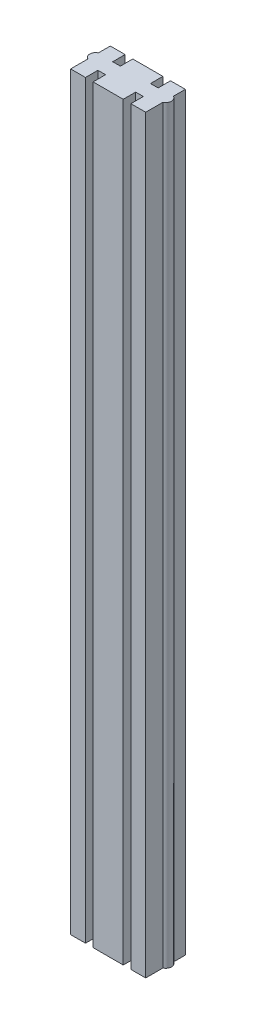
ISO-10303-21;
HEADER;
FILE_DESCRIPTION(('STEP AP214'),'2;1');
FILE_NAME('part.step','',(''),(''),'','','');
FILE_SCHEMA(('AUTOMOTIVE_DESIGN { 1 0 10303 214 1 1 1 1 }'));
ENDSEC;
DATA;
#1=APPLICATION_CONTEXT('core data for automotive mechanical design processes');
#2=APPLICATION_PROTOCOL_DEFINITION('international standard','automotive_design',2000,#1);
#3=PRODUCT_CONTEXT('',#1,'mechanical');
#4=PRODUCT('Part','Part','',(#3));
#5=PRODUCT_RELATED_PRODUCT_CATEGORY('part','',(#4));
#6=PRODUCT_DEFINITION_FORMATION('','',#4);
#7=PRODUCT_DEFINITION_CONTEXT('part definition',#1,'design');
#8=PRODUCT_DEFINITION('design','',#6,#7);
#9=PRODUCT_DEFINITION_SHAPE('','',#8);
#10=(LENGTH_UNIT() NAMED_UNIT(*) SI_UNIT(.MILLI.,.METRE.));
#11=(NAMED_UNIT(*) PLANE_ANGLE_UNIT() SI_UNIT($,.RADIAN.));
#12=(NAMED_UNIT(*) SI_UNIT($,.STERADIAN.) SOLID_ANGLE_UNIT());
#13=UNCERTAINTY_MEASURE_WITH_UNIT(LENGTH_MEASURE(1.E-05),#10,'distance_accuracy_value','');
#14=(GEOMETRIC_REPRESENTATION_CONTEXT(3) GLOBAL_UNCERTAINTY_ASSIGNED_CONTEXT((#13)) GLOBAL_UNIT_ASSIGNED_CONTEXT((#10,
#11,#12)) REPRESENTATION_CONTEXT('',''));
#15=CARTESIAN_POINT('',(0.,0.,0.));
#16=DIRECTION('',(0.,0.,1.));
#17=DIRECTION('',(1.,0.,0.));
#18=AXIS2_PLACEMENT_3D('',#15,#16,#17);
#19=CARTESIAN_POINT('',(0.,398.4625,0.));
#20=DIRECTION('',(1.,0.,0.));
#21=DIRECTION('',(0.,0.,-1.));
#22=AXIS2_PLACEMENT_3D('',#19,#20,#21);
#23=PLANE('',#22);
#24=DIRECTION('',(0.,0.,1.));
#25=VECTOR('',#24,1.);
#26=CARTESIAN_POINT('',(0.,0.,0.));
#27=LINE('',#26,#25);
#28=CARTESIAN_POINT('',(0.,0.,-9.16718712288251));
#29=VERTEX_POINT('',#28);
#30=CARTESIAN_POINT('',(0.,0.,0.));
#31=VERTEX_POINT('',#30);
#32=EDGE_CURVE('E236',#29,#31,#27,.T.);
#33=ORIENTED_EDGE('',*,*,#32,.T.);
#34=DIRECTION('',(0.,-1.,0.));
#35=VECTOR('',#34,1.);
#36=CARTESIAN_POINT('',(0.,398.4625,0.));
#37=LINE('',#36,#35);
#38=CARTESIAN_POINT('',(0.,398.4625,0.));
#39=VERTEX_POINT('',#38);
#40=EDGE_CURVE('E11',#39,#31,#37,.T.);
#41=ORIENTED_EDGE('',*,*,#40,.F.);
#42=DIRECTION('',(0.,0.,1.));
#43=VECTOR('',#42,1.);
#44=CARTESIAN_POINT('',(0.,398.4625,0.));
#45=LINE('',#44,#43);
#46=CARTESIAN_POINT('',(0.,398.4625,-9.16718712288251));
#47=VERTEX_POINT('',#46);
#48=EDGE_CURVE('E306',#47,#39,#45,.T.);
#49=ORIENTED_EDGE('',*,*,#48,.F.);
#50=DIRECTION('',(0.,-1.,0.));
#51=VECTOR('',#50,1.);
#52=CARTESIAN_POINT('',(0.,398.4625,-9.16718712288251));
#53=LINE('',#52,#51);
#54=EDGE_CURVE('E232',#47,#29,#53,.T.);
#55=ORIENTED_EDGE('',*,*,#54,.T.);
#56=EDGE_LOOP('',(#33,#41,#49,#55));
#57=FACE_BOUND('',#56,.T.);
#58=ADVANCED_FACE('F39',(#57),#23,.F.);
#59=CARTESIAN_POINT('',(0.,398.4625,0.));
#60=DIRECTION('',(0.,0.,-1.));
#61=DIRECTION('',(-1.,0.,0.));
#62=AXIS2_PLACEMENT_3D('',#59,#60,#61);
#63=PLANE('',#62);
#64=DIRECTION('',(1.,0.,0.));
#65=VECTOR('',#64,1.);
#66=CARTESIAN_POINT('',(0.,0.,0.));
#67=LINE('',#66,#65);
#68=CARTESIAN_POINT('',(7.874,0.,0.));
#69=VERTEX_POINT('',#68);
#70=EDGE_CURVE('E240',#31,#69,#67,.T.);
#71=ORIENTED_EDGE('',*,*,#70,.T.);
#72=DIRECTION('',(0.,-1.,0.));
#73=VECTOR('',#72,1.);
#74=CARTESIAN_POINT('',(7.874,398.4625,0.));
#75=LINE('',#74,#73);
#76=CARTESIAN_POINT('',(7.874,398.4625,0.));
#77=VERTEX_POINT('',#76);
#78=EDGE_CURVE('E48',#77,#69,#75,.T.);
#79=ORIENTED_EDGE('',*,*,#78,.F.);
#80=DIRECTION('',(1.,0.,0.));
#81=VECTOR('',#80,1.);
#82=CARTESIAN_POINT('',(0.,398.4625,0.));
#83=LINE('',#82,#81);
#84=EDGE_CURVE('E147',#39,#77,#83,.T.);
#85=ORIENTED_EDGE('',*,*,#84,.F.);
#86=ORIENTED_EDGE('',*,*,#40,.T.);
#87=EDGE_LOOP('',(#71,#79,#85,#86));
#88=FACE_BOUND('',#87,.T.);
#89=ADVANCED_FACE('F484',(#88),#63,.F.);
#90=CARTESIAN_POINT('',(7.874,398.4625,0.));
#91=DIRECTION('',(-1.,0.,0.));
#92=DIRECTION('',(0.,0.,1.));
#93=AXIS2_PLACEMENT_3D('',#90,#91,#92);
#94=PLANE('',#93);
#95=DIRECTION('',(0.,0.,-1.));
#96=VECTOR('',#95,1.);
#97=CARTESIAN_POINT('',(7.874,0.,0.));
#98=LINE('',#97,#96);
#99=CARTESIAN_POINT('',(7.874,0.,-6.604));
#100=VERTEX_POINT('',#99);
#101=EDGE_CURVE('E243',#69,#100,#98,.T.);
#102=ORIENTED_EDGE('',*,*,#101,.T.);
#103=DIRECTION('',(0.,-1.,0.));
#104=VECTOR('',#103,1.);
#105=CARTESIAN_POINT('',(7.874,398.4625,-6.604));
#106=LINE('',#105,#104);
#107=CARTESIAN_POINT('',(7.874,398.4625,-6.604));
#108=VERTEX_POINT('',#107);
#109=EDGE_CURVE('E381',#108,#100,#106,.T.);
#110=ORIENTED_EDGE('',*,*,#109,.F.);
#111=DIRECTION('',(0.,0.,-1.));
#112=VECTOR('',#111,1.);
#113=CARTESIAN_POINT('',(7.874,398.4625,0.));
#114=LINE('',#113,#112);
#115=EDGE_CURVE('E391',#77,#108,#114,.T.);
#116=ORIENTED_EDGE('',*,*,#115,.F.);
#117=ORIENTED_EDGE('',*,*,#78,.T.);
#118=EDGE_LOOP('',(#102,#110,#116,#117));
#119=FACE_BOUND('',#118,.T.);
#120=ADVANCED_FACE('F389',(#119),#94,.F.);
#121=CARTESIAN_POINT('',(7.874,398.4625,-6.604));
#122=DIRECTION('',(0.,0.,-1.));
#123=DIRECTION('',(-1.,0.,0.));
#124=AXIS2_PLACEMENT_3D('',#121,#122,#123);
#125=PLANE('',#124);
#126=DIRECTION('',(1.,0.,0.));
#127=VECTOR('',#126,1.);
#128=CARTESIAN_POINT('',(7.874,0.,-6.604));
#129=LINE('',#128,#127);
#130=CARTESIAN_POINT('',(11.938,0.,-6.604));
#131=VERTEX_POINT('',#130);
#132=EDGE_CURVE('E246',#100,#131,#129,.T.);
#133=ORIENTED_EDGE('',*,*,#132,.T.);
#134=DIRECTION('',(0.,-1.,0.));
#135=VECTOR('',#134,1.);
#136=CARTESIAN_POINT('',(11.938,398.4625,-6.604));
#137=LINE('',#136,#135);
#138=CARTESIAN_POINT('',(11.938,398.4625,-6.604));
#139=VERTEX_POINT('',#138);
#140=EDGE_CURVE('E377',#139,#131,#137,.T.);
#141=ORIENTED_EDGE('',*,*,#140,.F.);
#142=DIRECTION('',(1.,0.,0.));
#143=VECTOR('',#142,1.);
#144=CARTESIAN_POINT('',(7.874,398.4625,-6.604));
#145=LINE('',#144,#143);
#146=EDGE_CURVE('E410',#108,#139,#145,.T.);
#147=ORIENTED_EDGE('',*,*,#146,.F.);
#148=ORIENTED_EDGE('',*,*,#109,.T.);
#149=EDGE_LOOP('',(#133,#141,#147,#148));
#150=FACE_BOUND('',#149,.T.);
#151=ADVANCED_FACE('F400',(#150),#125,.F.);
#152=CARTESIAN_POINT('',(11.938,398.4625,0.));
#153=DIRECTION('',(1.,0.,0.));
#154=DIRECTION('',(0.,0.,-1.));
#155=AXIS2_PLACEMENT_3D('',#152,#153,#154);
#156=PLANE('',#155);
#157=DIRECTION('',(0.,0.,1.));
#158=VECTOR('',#157,1.);
#159=CARTESIAN_POINT('',(11.938,0.,0.));
#160=LINE('',#159,#158);
#161=CARTESIAN_POINT('',(11.938,0.,0.));
#162=VERTEX_POINT('',#161);
#163=EDGE_CURVE('E249',#131,#162,#160,.T.);
#164=ORIENTED_EDGE('',*,*,#163,.T.);
#165=DIRECTION('',(0.,-1.,0.));
#166=VECTOR('',#165,1.);
#167=CARTESIAN_POINT('',(11.938,398.4625,0.));
#168=LINE('',#167,#166);
#169=CARTESIAN_POINT('',(11.938,398.4625,0.));
#170=VERTEX_POINT('',#169);
#171=EDGE_CURVE('E373',#170,#162,#168,.T.);
#172=ORIENTED_EDGE('',*,*,#171,.F.);
#173=DIRECTION('',(0.,0.,1.));
#174=VECTOR('',#173,1.);
#175=CARTESIAN_POINT('',(11.938,398.4625,0.));
#176=LINE('',#175,#174);
#177=EDGE_CURVE('E406',#139,#170,#176,.T.);
#178=ORIENTED_EDGE('',*,*,#177,.F.);
#179=ORIENTED_EDGE('',*,*,#140,.T.);
#180=EDGE_LOOP('',(#164,#172,#178,#179));
#181=FACE_BOUND('',#180,.T.);
#182=ADVANCED_FACE('F404',(#181),#156,.F.);
#183=CARTESIAN_POINT('',(11.938,398.4625,0.));
#184=DIRECTION('',(0.,0.,-1.));
#185=DIRECTION('',(-1.,0.,0.));
#186=AXIS2_PLACEMENT_3D('',#183,#184,#185);
#187=PLANE('',#186);
#188=DIRECTION('',(1.,0.,0.));
#189=VECTOR('',#188,1.);
#190=CARTESIAN_POINT('',(11.938,0.,0.));
#191=LINE('',#190,#189);
#192=CARTESIAN_POINT('',(27.94,0.,0.));
#193=VERTEX_POINT('',#192);
#194=EDGE_CURVE('E252',#162,#193,#191,.T.);
#195=ORIENTED_EDGE('',*,*,#194,.T.);
#196=DIRECTION('',(0.,-1.,0.));
#197=VECTOR('',#196,1.);
#198=CARTESIAN_POINT('',(27.94,398.4625,0.));
#199=LINE('',#198,#197);
#200=CARTESIAN_POINT('',(27.94,398.4625,0.));
#201=VERTEX_POINT('',#200);
#202=EDGE_CURVE('E369',#201,#193,#199,.T.);
#203=ORIENTED_EDGE('',*,*,#202,.F.);
#204=DIRECTION('',(1.,0.,0.));
#205=VECTOR('',#204,1.);
#206=CARTESIAN_POINT('',(11.938,398.4625,0.));
#207=LINE('',#206,#205);
#208=EDGE_CURVE('E409',#170,#201,#207,.T.);
#209=ORIENTED_EDGE('',*,*,#208,.F.);
#210=ORIENTED_EDGE('',*,*,#171,.T.);
#211=EDGE_LOOP('',(#195,#203,#209,#210));
#212=FACE_BOUND('',#211,.T.);
#213=ADVANCED_FACE('F497',(#212),#187,.F.);
#214=CARTESIAN_POINT('',(27.94,398.4625,0.));
#215=DIRECTION('',(-1.,0.,0.));
#216=DIRECTION('',(0.,0.,1.));
#217=AXIS2_PLACEMENT_3D('',#214,#215,#216);
#218=PLANE('',#217);
#219=DIRECTION('',(0.,0.,-1.));
#220=VECTOR('',#219,1.);
#221=CARTESIAN_POINT('',(27.94,0.,0.));
#222=LINE('',#221,#220);
#223=CARTESIAN_POINT('',(27.94,0.,-6.604));
#224=VERTEX_POINT('',#223);
#225=EDGE_CURVE('E255',#193,#224,#222,.T.);
#226=ORIENTED_EDGE('',*,*,#225,.T.);
#227=DIRECTION('',(0.,-1.,0.));
#228=VECTOR('',#227,1.);
#229=CARTESIAN_POINT('',(27.94,398.4625,-6.604));
#230=LINE('',#229,#228);
#231=CARTESIAN_POINT('',(27.94,398.4625,-6.604));
#232=VERTEX_POINT('',#231);
#233=EDGE_CURVE('E365',#232,#224,#230,.T.);
#234=ORIENTED_EDGE('',*,*,#233,.F.);
#235=DIRECTION('',(0.,0.,-1.));
#236=VECTOR('',#235,1.);
#237=CARTESIAN_POINT('',(27.94,398.4625,0.));
#238=LINE('',#237,#236);
#239=EDGE_CURVE('E414',#201,#232,#238,.T.);
#240=ORIENTED_EDGE('',*,*,#239,.F.);
#241=ORIENTED_EDGE('',*,*,#202,.T.);
#242=EDGE_LOOP('',(#226,#234,#240,#241));
#243=FACE_BOUND('',#242,.T.);
#244=ADVANCED_FACE('F500',(#243),#218,.F.);
#245=CARTESIAN_POINT('',(32.004,398.4625,-6.604));
#246=DIRECTION('',(0.,0.,-1.));
#247=DIRECTION('',(-1.,0.,0.));
#248=AXIS2_PLACEMENT_3D('',#245,#246,#247);
#249=PLANE('',#248);
#250=DIRECTION('',(1.,0.,0.));
#251=VECTOR('',#250,1.);
#252=CARTESIAN_POINT('',(32.004,0.,-6.604));
#253=LINE('',#252,#251);
#254=CARTESIAN_POINT('',(32.004,0.,-6.604));
#255=VERTEX_POINT('',#254);
#256=EDGE_CURVE('E258',#224,#255,#253,.T.);
#257=ORIENTED_EDGE('',*,*,#256,.T.);
#258=DIRECTION('',(0.,-1.,0.));
#259=VECTOR('',#258,1.);
#260=CARTESIAN_POINT('',(32.004,398.4625,-6.604));
#261=LINE('',#260,#259);
#262=CARTESIAN_POINT('',(32.004,398.4625,-6.604));
#263=VERTEX_POINT('',#262);
#264=EDGE_CURVE('E361',#263,#255,#261,.T.);
#265=ORIENTED_EDGE('',*,*,#264,.F.);
#266=DIRECTION('',(1.,0.,0.));
#267=VECTOR('',#266,1.);
#268=CARTESIAN_POINT('',(32.004,398.4625,-6.604));
#269=LINE('',#268,#267);
#270=EDGE_CURVE('E421',#232,#263,#269,.T.);
#271=ORIENTED_EDGE('',*,*,#270,.F.);
#272=ORIENTED_EDGE('',*,*,#233,.T.);
#273=EDGE_LOOP('',(#257,#265,#271,#272));
#274=FACE_BOUND('',#273,.T.);
#275=ADVANCED_FACE('F504',(#274),#249,.F.);
#276=CARTESIAN_POINT('',(32.004,398.4625,0.));
#277=DIRECTION('',(1.,0.,0.));
#278=DIRECTION('',(0.,0.,-1.));
#279=AXIS2_PLACEMENT_3D('',#276,#277,#278);
#280=PLANE('',#279);
#281=DIRECTION('',(0.,0.,1.));
#282=VECTOR('',#281,1.);
#283=CARTESIAN_POINT('',(32.004,0.,0.));
#284=LINE('',#283,#282);
#285=CARTESIAN_POINT('',(32.004,0.,0.));
#286=VERTEX_POINT('',#285);
#287=EDGE_CURVE('E261',#255,#286,#284,.T.);
#288=ORIENTED_EDGE('',*,*,#287,.T.);
#289=DIRECTION('',(0.,-1.,0.));
#290=VECTOR('',#289,1.);
#291=CARTESIAN_POINT('',(32.004,398.4625,0.));
#292=LINE('',#291,#290);
#293=CARTESIAN_POINT('',(32.004,398.4625,0.));
#294=VERTEX_POINT('',#293);
#295=EDGE_CURVE('E357',#294,#286,#292,.T.);
#296=ORIENTED_EDGE('',*,*,#295,.F.);
#297=DIRECTION('',(0.,0.,1.));
#298=VECTOR('',#297,1.);
#299=CARTESIAN_POINT('',(32.004,398.4625,0.));
#300=LINE('',#299,#298);
#301=EDGE_CURVE('E424',#263,#294,#300,.T.);
#302=ORIENTED_EDGE('',*,*,#301,.F.);
#303=ORIENTED_EDGE('',*,*,#264,.T.);
#304=EDGE_LOOP('',(#288,#296,#302,#303));
#305=FACE_BOUND('',#304,.T.);
#306=ADVANCED_FACE('F508',(#305),#280,.F.);
#307=CARTESIAN_POINT('',(32.004,398.4625,0.));
#308=DIRECTION('',(0.,0.,-1.));
#309=DIRECTION('',(-1.,0.,0.));
#310=AXIS2_PLACEMENT_3D('',#307,#308,#309);
#311=PLANE('',#310);
#312=DIRECTION('',(1.,0.,0.));
#313=VECTOR('',#312,1.);
#314=CARTESIAN_POINT('',(32.004,0.,0.));
#315=LINE('',#314,#313);
#316=CARTESIAN_POINT('',(39.878,0.,0.));
#317=VERTEX_POINT('',#316);
#318=EDGE_CURVE('E264',#286,#317,#315,.T.);
#319=ORIENTED_EDGE('',*,*,#318,.T.);
#320=DIRECTION('',(0.,-1.,0.));
#321=VECTOR('',#320,1.);
#322=CARTESIAN_POINT('',(39.878,398.4625,0.));
#323=LINE('',#322,#321);
#324=CARTESIAN_POINT('',(39.878,398.4625,0.));
#325=VERTEX_POINT('',#324);
#326=EDGE_CURVE('E353',#325,#317,#323,.T.);
#327=ORIENTED_EDGE('',*,*,#326,.F.);
#328=DIRECTION('',(1.,0.,0.));
#329=VECTOR('',#328,1.);
#330=CARTESIAN_POINT('',(32.004,398.4625,0.));
#331=LINE('',#330,#329);
#332=EDGE_CURVE('E427',#294,#325,#331,.T.);
#333=ORIENTED_EDGE('',*,*,#332,.F.);
#334=ORIENTED_EDGE('',*,*,#295,.T.);
#335=EDGE_LOOP('',(#319,#327,#333,#334));
#336=FACE_BOUND('',#335,.T.);
#337=ADVANCED_FACE('F512',(#336),#311,.F.);
#338=CARTESIAN_POINT('',(39.878,398.4625,0.));
#339=DIRECTION('',(-1.,0.,0.));
#340=DIRECTION('',(0.,0.,1.));
#341=AXIS2_PLACEMENT_3D('',#338,#339,#340);
#342=PLANE('',#341);
#343=DIRECTION('',(0.,0.,-1.));
#344=VECTOR('',#343,1.);
#345=CARTESIAN_POINT('',(39.878,0.,0.));
#346=LINE('',#345,#344);
#347=CARTESIAN_POINT('',(39.878,0.,-9.16718712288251));
#348=VERTEX_POINT('',#347);
#349=EDGE_CURVE('E267',#317,#348,#346,.T.);
#350=ORIENTED_EDGE('',*,*,#349,.T.);
#351=DIRECTION('',(0.,-1.,0.));
#352=VECTOR('',#351,1.);
#353=CARTESIAN_POINT('',(39.878,398.4625,-9.16718712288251));
#354=LINE('',#353,#352);
#355=CARTESIAN_POINT('',(39.878,398.4625,-9.16718712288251));
#356=VERTEX_POINT('',#355);
#357=EDGE_CURVE('E349',#356,#348,#354,.T.);
#358=ORIENTED_EDGE('',*,*,#357,.F.);
#359=DIRECTION('',(0.,0.,-1.));
#360=VECTOR('',#359,1.);
#361=CARTESIAN_POINT('',(39.878,398.4625,0.));
#362=LINE('',#361,#360);
#363=EDGE_CURVE('E430',#325,#356,#362,.T.);
#364=ORIENTED_EDGE('',*,*,#363,.F.);
#365=ORIENTED_EDGE('',*,*,#326,.T.);
#366=EDGE_LOOP('',(#350,#358,#364,#365));
#367=FACE_BOUND('',#366,.T.);
#368=ADVANCED_FACE('F516',(#367),#342,.F.);
#369=CARTESIAN_POINT('',(38.608,398.4625,-11.938));
#370=DIRECTION('',(0.,-1.,0.));
#371=DIRECTION('',(0.,0.,-1.));
#372=AXIS2_PLACEMENT_3D('',#369,#370,#371);
#373=CYLINDRICAL_SURFACE('',#372,3.04800000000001);
#374=CARTESIAN_POINT('',(38.608,0.,-11.938));
#375=DIRECTION('',(0.,1.,0.));
#376=DIRECTION('',(0.,0.,1.));
#377=AXIS2_PLACEMENT_3D('',#374,#375,#376);
#378=CIRCLE('',#377,3.04800000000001);
#379=CARTESIAN_POINT('',(39.878,0.,-14.7088128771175));
#380=VERTEX_POINT('',#379);
#381=EDGE_CURVE('E270',#348,#380,#378,.T.);
#382=ORIENTED_EDGE('',*,*,#381,.T.);
#383=DIRECTION('',(0.,-1.,0.));
#384=VECTOR('',#383,1.);
#385=CARTESIAN_POINT('',(39.878,398.4625,-14.7088128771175));
#386=LINE('',#385,#384);
#387=CARTESIAN_POINT('',(39.878,398.4625,-14.7088128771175));
#388=VERTEX_POINT('',#387);
#389=EDGE_CURVE('E345',#388,#380,#386,.T.);
#390=ORIENTED_EDGE('',*,*,#389,.F.);
#391=CARTESIAN_POINT('',(38.608,398.4625,-11.938));
#392=DIRECTION('',(0.,1.,0.));
#393=DIRECTION('',(0.,0.,1.));
#394=AXIS2_PLACEMENT_3D('',#391,#392,#393);
#395=CIRCLE('',#394,3.04800000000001);
#396=EDGE_CURVE('E433',#356,#388,#395,.T.);
#397=ORIENTED_EDGE('',*,*,#396,.F.);
#398=ORIENTED_EDGE('',*,*,#357,.T.);
#399=EDGE_LOOP('',(#382,#390,#397,#398));
#400=FACE_BOUND('',#399,.T.);
#401=ADVANCED_FACE('F520',(#400),#373,.T.);
#402=CARTESIAN_POINT('',(39.878,398.4625,-14.7088128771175));
#403=DIRECTION('',(-1.,0.,0.));
#404=DIRECTION('',(0.,0.,1.));
#405=AXIS2_PLACEMENT_3D('',#402,#403,#404);
#406=PLANE('',#405);
#407=DIRECTION('',(0.,0.,-1.));
#408=VECTOR('',#407,1.);
#409=CARTESIAN_POINT('',(39.878,0.,-14.7088128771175));
#410=LINE('',#409,#408);
#411=CARTESIAN_POINT('',(39.878,0.,-21.082));
#412=VERTEX_POINT('',#411);
#413=EDGE_CURVE('E273',#380,#412,#410,.T.);
#414=ORIENTED_EDGE('',*,*,#413,.T.);
#415=DIRECTION('',(0.,-1.,0.));
#416=VECTOR('',#415,1.);
#417=CARTESIAN_POINT('',(39.878,398.4625,-21.082));
#418=LINE('',#417,#416);
#419=CARTESIAN_POINT('',(39.878,398.4625,-21.082));
#420=VERTEX_POINT('',#419);
#421=EDGE_CURVE('E341',#420,#412,#418,.T.);
#422=ORIENTED_EDGE('',*,*,#421,.F.);
#423=DIRECTION('',(0.,0.,-1.));
#424=VECTOR('',#423,1.);
#425=CARTESIAN_POINT('',(39.878,398.4625,-14.7088128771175));
#426=LINE('',#425,#424);
#427=EDGE_CURVE('E436',#388,#420,#426,.T.);
#428=ORIENTED_EDGE('',*,*,#427,.F.);
#429=ORIENTED_EDGE('',*,*,#389,.T.);
#430=EDGE_LOOP('',(#414,#422,#428,#429));
#431=FACE_BOUND('',#430,.T.);
#432=ADVANCED_FACE('F524',(#431),#406,.F.);
#433=CARTESIAN_POINT('',(32.004,398.4625,-21.082));
#434=DIRECTION('',(0.,0.,1.));
#435=DIRECTION('',(1.,0.,0.));
#436=AXIS2_PLACEMENT_3D('',#433,#434,#435);
#437=PLANE('',#436);
#438=DIRECTION('',(-1.,0.,0.));
#439=VECTOR('',#438,1.);
#440=CARTESIAN_POINT('',(32.004,0.,-21.082));
#441=LINE('',#440,#439);
#442=CARTESIAN_POINT('',(32.004,0.,-21.082));
#443=VERTEX_POINT('',#442);
#444=EDGE_CURVE('E276',#412,#443,#441,.T.);
#445=ORIENTED_EDGE('',*,*,#444,.T.);
#446=DIRECTION('',(0.,-1.,0.));
#447=VECTOR('',#446,1.);
#448=CARTESIAN_POINT('',(32.004,398.4625,-21.082));
#449=LINE('',#448,#447);
#450=CARTESIAN_POINT('',(32.004,398.4625,-21.082));
#451=VERTEX_POINT('',#450);
#452=EDGE_CURVE('E337',#451,#443,#449,.T.);
#453=ORIENTED_EDGE('',*,*,#452,.F.);
#454=DIRECTION('',(-1.,0.,0.));
#455=VECTOR('',#454,1.);
#456=CARTESIAN_POINT('',(32.004,398.4625,-21.082));
#457=LINE('',#456,#455);
#458=EDGE_CURVE('E439',#420,#451,#457,.T.);
#459=ORIENTED_EDGE('',*,*,#458,.F.);
#460=ORIENTED_EDGE('',*,*,#421,.T.);
#461=EDGE_LOOP('',(#445,#453,#459,#460));
#462=FACE_BOUND('',#461,.T.);
#463=ADVANCED_FACE('F528',(#462),#437,.F.);
#464=CARTESIAN_POINT('',(32.004,398.4625,-21.082));
#465=DIRECTION('',(1.,0.,0.));
#466=DIRECTION('',(0.,0.,-1.));
#467=AXIS2_PLACEMENT_3D('',#464,#465,#466);
#468=PLANE('',#467);
#469=DIRECTION('',(0.,0.,1.));
#470=VECTOR('',#469,1.);
#471=CARTESIAN_POINT('',(32.004,0.,-21.082));
#472=LINE('',#471,#470);
#473=CARTESIAN_POINT('',(32.004,0.,-14.478));
#474=VERTEX_POINT('',#473);
#475=EDGE_CURVE('E279',#443,#474,#472,.T.);
#476=ORIENTED_EDGE('',*,*,#475,.T.);
#477=DIRECTION('',(0.,-1.,0.));
#478=VECTOR('',#477,1.);
#479=CARTESIAN_POINT('',(32.004,398.4625,-14.478));
#480=LINE('',#479,#478);
#481=CARTESIAN_POINT('',(32.004,398.4625,-14.478));
#482=VERTEX_POINT('',#481);
#483=EDGE_CURVE('E333',#482,#474,#480,.T.);
#484=ORIENTED_EDGE('',*,*,#483,.F.);
#485=DIRECTION('',(0.,0.,1.));
#486=VECTOR('',#485,1.);
#487=CARTESIAN_POINT('',(32.004,398.4625,-21.082));
#488=LINE('',#487,#486);
#489=EDGE_CURVE('E442',#451,#482,#488,.T.);
#490=ORIENTED_EDGE('',*,*,#489,.F.);
#491=ORIENTED_EDGE('',*,*,#452,.T.);
#492=EDGE_LOOP('',(#476,#484,#490,#491));
#493=FACE_BOUND('',#492,.T.);
#494=ADVANCED_FACE('F532',(#493),#468,.F.);
#495=CARTESIAN_POINT('',(32.004,398.4625,-14.478));
#496=DIRECTION('',(0.,0.,1.));
#497=DIRECTION('',(1.,0.,0.));
#498=AXIS2_PLACEMENT_3D('',#495,#496,#497);
#499=PLANE('',#498);
#500=DIRECTION('',(-1.,0.,0.));
#501=VECTOR('',#500,1.);
#502=CARTESIAN_POINT('',(32.004,0.,-14.478));
#503=LINE('',#502,#501);
#504=CARTESIAN_POINT('',(27.94,0.,-14.478));
#505=VERTEX_POINT('',#504);
#506=EDGE_CURVE('E282',#474,#505,#503,.T.);
#507=ORIENTED_EDGE('',*,*,#506,.T.);
#508=DIRECTION('',(0.,-1.,0.));
#509=VECTOR('',#508,1.);
#510=CARTESIAN_POINT('',(27.94,398.4625,-14.478));
#511=LINE('',#510,#509);
#512=CARTESIAN_POINT('',(27.94,398.4625,-14.478));
#513=VERTEX_POINT('',#512);
#514=EDGE_CURVE('E329',#513,#505,#511,.T.);
#515=ORIENTED_EDGE('',*,*,#514,.F.);
#516=DIRECTION('',(-1.,0.,0.));
#517=VECTOR('',#516,1.);
#518=CARTESIAN_POINT('',(32.004,398.4625,-14.478));
#519=LINE('',#518,#517);
#520=EDGE_CURVE('E445',#482,#513,#519,.T.);
#521=ORIENTED_EDGE('',*,*,#520,.F.);
#522=ORIENTED_EDGE('',*,*,#483,.T.);
#523=EDGE_LOOP('',(#507,#515,#521,#522));
#524=FACE_BOUND('',#523,.T.);
#525=ADVANCED_FACE('F536',(#524),#499,.F.);
#526=CARTESIAN_POINT('',(27.94,398.4625,-21.082));
#527=DIRECTION('',(-1.,0.,0.));
#528=DIRECTION('',(0.,0.,1.));
#529=AXIS2_PLACEMENT_3D('',#526,#527,#528);
#530=PLANE('',#529);
#531=DIRECTION('',(0.,0.,-1.));
#532=VECTOR('',#531,1.);
#533=CARTESIAN_POINT('',(27.94,0.,-21.082));
#534=LINE('',#533,#532);
#535=CARTESIAN_POINT('',(27.94,0.,-21.082));
#536=VERTEX_POINT('',#535);
#537=EDGE_CURVE('E285',#505,#536,#534,.T.);
#538=ORIENTED_EDGE('',*,*,#537,.T.);
#539=DIRECTION('',(0.,-1.,0.));
#540=VECTOR('',#539,1.);
#541=CARTESIAN_POINT('',(27.94,398.4625,-21.082));
#542=LINE('',#541,#540);
#543=CARTESIAN_POINT('',(27.94,398.4625,-21.082));
#544=VERTEX_POINT('',#543);
#545=EDGE_CURVE('E325',#544,#536,#542,.T.);
#546=ORIENTED_EDGE('',*,*,#545,.F.);
#547=DIRECTION('',(0.,0.,-1.));
#548=VECTOR('',#547,1.);
#549=CARTESIAN_POINT('',(27.94,398.4625,-21.082));
#550=LINE('',#549,#548);
#551=EDGE_CURVE('E448',#513,#544,#550,.T.);
#552=ORIENTED_EDGE('',*,*,#551,.F.);
#553=ORIENTED_EDGE('',*,*,#514,.T.);
#554=EDGE_LOOP('',(#538,#546,#552,#553));
#555=FACE_BOUND('',#554,.T.);
#556=ADVANCED_FACE('F540',(#555),#530,.F.);
#557=CARTESIAN_POINT('',(11.938,398.4625,-21.082));
#558=DIRECTION('',(0.,0.,1.));
#559=DIRECTION('',(1.,0.,0.));
#560=AXIS2_PLACEMENT_3D('',#557,#558,#559);
#561=PLANE('',#560);
#562=DIRECTION('',(-1.,0.,0.));
#563=VECTOR('',#562,1.);
#564=CARTESIAN_POINT('',(11.938,0.,-21.082));
#565=LINE('',#564,#563);
#566=CARTESIAN_POINT('',(11.938,0.,-21.082));
#567=VERTEX_POINT('',#566);
#568=EDGE_CURVE('E288',#536,#567,#565,.T.);
#569=ORIENTED_EDGE('',*,*,#568,.T.);
#570=DIRECTION('',(0.,-1.,0.));
#571=VECTOR('',#570,1.);
#572=CARTESIAN_POINT('',(11.938,398.4625,-21.082));
#573=LINE('',#572,#571);
#574=CARTESIAN_POINT('',(11.938,398.4625,-21.082));
#575=VERTEX_POINT('',#574);
#576=EDGE_CURVE('E321',#575,#567,#573,.T.);
#577=ORIENTED_EDGE('',*,*,#576,.F.);
#578=DIRECTION('',(-1.,0.,0.));
#579=VECTOR('',#578,1.);
#580=CARTESIAN_POINT('',(11.938,398.4625,-21.082));
#581=LINE('',#580,#579);
#582=EDGE_CURVE('E451',#544,#575,#581,.T.);
#583=ORIENTED_EDGE('',*,*,#582,.F.);
#584=ORIENTED_EDGE('',*,*,#545,.T.);
#585=EDGE_LOOP('',(#569,#577,#583,#584));
#586=FACE_BOUND('',#585,.T.);
#587=ADVANCED_FACE('F544',(#586),#561,.F.);
#588=CARTESIAN_POINT('',(11.938,398.4625,-21.082));
#589=DIRECTION('',(1.,0.,0.));
#590=DIRECTION('',(0.,0.,-1.));
#591=AXIS2_PLACEMENT_3D('',#588,#589,#590);
#592=PLANE('',#591);
#593=DIRECTION('',(0.,0.,1.));
#594=VECTOR('',#593,1.);
#595=CARTESIAN_POINT('',(11.938,0.,-21.082));
#596=LINE('',#595,#594);
#597=CARTESIAN_POINT('',(11.938,0.,-14.478));
#598=VERTEX_POINT('',#597);
#599=EDGE_CURVE('E291',#567,#598,#596,.T.);
#600=ORIENTED_EDGE('',*,*,#599,.T.);
#601=DIRECTION('',(0.,-1.,0.));
#602=VECTOR('',#601,1.);
#603=CARTESIAN_POINT('',(11.938,398.4625,-14.478));
#604=LINE('',#603,#602);
#605=CARTESIAN_POINT('',(11.938,398.4625,-14.478));
#606=VERTEX_POINT('',#605);
#607=EDGE_CURVE('E317',#606,#598,#604,.T.);
#608=ORIENTED_EDGE('',*,*,#607,.F.);
#609=DIRECTION('',(0.,0.,1.));
#610=VECTOR('',#609,1.);
#611=CARTESIAN_POINT('',(11.938,398.4625,-21.082));
#612=LINE('',#611,#610);
#613=EDGE_CURVE('E454',#575,#606,#612,.T.);
#614=ORIENTED_EDGE('',*,*,#613,.F.);
#615=ORIENTED_EDGE('',*,*,#576,.T.);
#616=EDGE_LOOP('',(#600,#608,#614,#615));
#617=FACE_BOUND('',#616,.T.);
#618=ADVANCED_FACE('F548',(#617),#592,.F.);
#619=CARTESIAN_POINT('',(7.874,398.4625,-14.478));
#620=DIRECTION('',(0.,0.,1.));
#621=DIRECTION('',(1.,0.,0.));
#622=AXIS2_PLACEMENT_3D('',#619,#620,#621);
#623=PLANE('',#622);
#624=DIRECTION('',(-1.,0.,0.));
#625=VECTOR('',#624,1.);
#626=CARTESIAN_POINT('',(7.874,0.,-14.478));
#627=LINE('',#626,#625);
#628=CARTESIAN_POINT('',(7.874,0.,-14.478));
#629=VERTEX_POINT('',#628);
#630=EDGE_CURVE('E294',#598,#629,#627,.T.);
#631=ORIENTED_EDGE('',*,*,#630,.T.);
#632=DIRECTION('',(0.,-1.,0.));
#633=VECTOR('',#632,1.);
#634=CARTESIAN_POINT('',(7.874,398.4625,-14.478));
#635=LINE('',#634,#633);
#636=CARTESIAN_POINT('',(7.874,398.4625,-14.478));
#637=VERTEX_POINT('',#636);
#638=EDGE_CURVE('E313',#637,#629,#635,.T.);
#639=ORIENTED_EDGE('',*,*,#638,.F.);
#640=DIRECTION('',(-1.,0.,0.));
#641=VECTOR('',#640,1.);
#642=CARTESIAN_POINT('',(7.874,398.4625,-14.478));
#643=LINE('',#642,#641);
#644=EDGE_CURVE('E457',#606,#637,#643,.T.);
#645=ORIENTED_EDGE('',*,*,#644,.F.);
#646=ORIENTED_EDGE('',*,*,#607,.T.);
#647=EDGE_LOOP('',(#631,#639,#645,#646));
#648=FACE_BOUND('',#647,.T.);
#649=ADVANCED_FACE('F465',(#648),#623,.F.);
#650=CARTESIAN_POINT('',(7.874,398.4625,-21.082));
#651=DIRECTION('',(-1.,0.,0.));
#652=DIRECTION('',(0.,0.,1.));
#653=AXIS2_PLACEMENT_3D('',#650,#651,#652);
#654=PLANE('',#653);
#655=DIRECTION('',(0.,0.,-1.));
#656=VECTOR('',#655,1.);
#657=CARTESIAN_POINT('',(7.874,0.,-21.082));
#658=LINE('',#657,#656);
#659=CARTESIAN_POINT('',(7.874,0.,-21.082));
#660=VERTEX_POINT('',#659);
#661=EDGE_CURVE('E297',#629,#660,#658,.T.);
#662=ORIENTED_EDGE('',*,*,#661,.T.);
#663=DIRECTION('',(0.,-1.,0.));
#664=VECTOR('',#663,1.);
#665=CARTESIAN_POINT('',(7.874,398.4625,-21.082));
#666=LINE('',#665,#664);
#667=CARTESIAN_POINT('',(7.874,398.4625,-21.082));
#668=VERTEX_POINT('',#667);
#669=EDGE_CURVE('E225',#668,#660,#666,.T.);
#670=ORIENTED_EDGE('',*,*,#669,.F.);
#671=DIRECTION('',(0.,0.,-1.));
#672=VECTOR('',#671,1.);
#673=CARTESIAN_POINT('',(7.874,398.4625,-21.082));
#674=LINE('',#673,#672);
#675=EDGE_CURVE('E214',#637,#668,#674,.T.);
#676=ORIENTED_EDGE('',*,*,#675,.F.);
#677=ORIENTED_EDGE('',*,*,#638,.T.);
#678=EDGE_LOOP('',(#662,#670,#676,#677));
#679=FACE_BOUND('',#678,.T.);
#680=ADVANCED_FACE('F469',(#679),#654,.F.);
#681=CARTESIAN_POINT('',(0.,398.4625,-21.082));
#682=DIRECTION('',(0.,0.,1.));
#683=DIRECTION('',(1.,0.,0.));
#684=AXIS2_PLACEMENT_3D('',#681,#682,#683);
#685=PLANE('',#684);
#686=DIRECTION('',(-1.,0.,0.));
#687=VECTOR('',#686,1.);
#688=CARTESIAN_POINT('',(0.,0.,-21.082));
#689=LINE('',#688,#687);
#690=CARTESIAN_POINT('',(0.,0.,-21.082));
#691=VERTEX_POINT('',#690);
#692=EDGE_CURVE('E223',#660,#691,#689,.T.);
#693=ORIENTED_EDGE('',*,*,#692,.T.);
#694=DIRECTION('',(0.,-1.,0.));
#695=VECTOR('',#694,1.);
#696=CARTESIAN_POINT('',(0.,398.4625,-21.082));
#697=LINE('',#696,#695);
#698=CARTESIAN_POINT('',(0.,398.4625,-21.082));
#699=VERTEX_POINT('',#698);
#700=EDGE_CURVE('E220',#699,#691,#697,.T.);
#701=ORIENTED_EDGE('',*,*,#700,.F.);
#702=DIRECTION('',(-1.,0.,0.));
#703=VECTOR('',#702,1.);
#704=CARTESIAN_POINT('',(0.,398.4625,-21.082));
#705=LINE('',#704,#703);
#706=EDGE_CURVE('E208',#668,#699,#705,.T.);
#707=ORIENTED_EDGE('',*,*,#706,.F.);
#708=ORIENTED_EDGE('',*,*,#669,.T.);
#709=EDGE_LOOP('',(#693,#701,#707,#708));
#710=FACE_BOUND('',#709,.T.);
#711=ADVANCED_FACE('F221',(#710),#685,.F.);
#712=CARTESIAN_POINT('',(0.,398.4625,-14.7088128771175));
#713=DIRECTION('',(1.,0.,0.));
#714=DIRECTION('',(0.,0.,-1.));
#715=AXIS2_PLACEMENT_3D('',#712,#713,#714);
#716=PLANE('',#715);
#717=DIRECTION('',(0.,0.,1.));
#718=VECTOR('',#717,1.);
#719=CARTESIAN_POINT('',(0.,0.,-14.7088128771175));
#720=LINE('',#719,#718);
#721=CARTESIAN_POINT('',(0.,0.,-14.7088128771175));
#722=VERTEX_POINT('',#721);
#723=EDGE_CURVE('E133',#691,#722,#720,.T.);
#724=ORIENTED_EDGE('',*,*,#723,.T.);
#725=DIRECTION('',(0.,-1.,0.));
#726=VECTOR('',#725,1.);
#727=CARTESIAN_POINT('',(0.,398.4625,-14.7088128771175));
#728=LINE('',#727,#726);
#729=CARTESIAN_POINT('',(0.,398.4625,-14.7088128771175));
#730=VERTEX_POINT('',#729);
#731=EDGE_CURVE('E226',#730,#722,#728,.T.);
#732=ORIENTED_EDGE('',*,*,#731,.F.);
#733=DIRECTION('',(0.,0.,1.));
#734=VECTOR('',#733,1.);
#735=CARTESIAN_POINT('',(0.,398.4625,-14.7088128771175));
#736=LINE('',#735,#734);
#737=EDGE_CURVE('E212',#699,#730,#736,.T.);
#738=ORIENTED_EDGE('',*,*,#737,.F.);
#739=ORIENTED_EDGE('',*,*,#700,.T.);
#740=EDGE_LOOP('',(#724,#732,#738,#739));
#741=FACE_BOUND('',#740,.T.);
#742=ADVANCED_FACE('F228',(#741),#716,.F.);
#743=CARTESIAN_POINT('',(1.26999999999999,398.4625,-11.938));
#744=DIRECTION('',(0.,-1.,0.));
#745=DIRECTION('',(0.,0.,-1.));
#746=AXIS2_PLACEMENT_3D('',#743,#744,#745);
#747=CYLINDRICAL_SURFACE('',#746,3.04800000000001);
#748=CARTESIAN_POINT('',(1.26999999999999,0.,-11.938));
#749=DIRECTION('',(0.,1.,0.));
#750=DIRECTION('',(0.,0.,-1.));
#751=AXIS2_PLACEMENT_3D('',#748,#749,#750);
#752=CIRCLE('',#751,3.04800000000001);
#753=EDGE_CURVE('E139',#722,#29,#752,.T.);
#754=ORIENTED_EDGE('',*,*,#753,.T.);
#755=ORIENTED_EDGE('',*,*,#54,.F.);
#756=CARTESIAN_POINT('',(1.26999999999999,398.4625,-11.938));
#757=DIRECTION('',(0.,1.,0.));
#758=DIRECTION('',(0.,0.,-1.));
#759=AXIS2_PLACEMENT_3D('',#756,#757,#758);
#760=CIRCLE('',#759,3.04800000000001);
#761=EDGE_CURVE('E56',#730,#47,#760,.T.);
#762=ORIENTED_EDGE('',*,*,#761,.F.);
#763=ORIENTED_EDGE('',*,*,#731,.T.);
#764=EDGE_LOOP('',(#754,#755,#762,#763));
#765=FACE_BOUND('',#764,.T.);
#766=ADVANCED_FACE('F473',(#765),#747,.T.);
#767=CARTESIAN_POINT('',(1.26999999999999,398.4625,-11.938));
#768=DIRECTION('',(0.,-1.,0.));
#769=DIRECTION('',(0.,0.,-1.));
#770=AXIS2_PLACEMENT_3D('',#767,#768,#769);
#771=PLANE('',#770);
#772=ORIENTED_EDGE('',*,*,#48,.T.);
#773=ORIENTED_EDGE('',*,*,#84,.T.);
#774=ORIENTED_EDGE('',*,*,#115,.T.);
#775=ORIENTED_EDGE('',*,*,#146,.T.);
#776=ORIENTED_EDGE('',*,*,#177,.T.);
#777=ORIENTED_EDGE('',*,*,#208,.T.);
#778=ORIENTED_EDGE('',*,*,#239,.T.);
#779=ORIENTED_EDGE('',*,*,#270,.T.);
#780=ORIENTED_EDGE('',*,*,#301,.T.);
#781=ORIENTED_EDGE('',*,*,#332,.T.);
#782=ORIENTED_EDGE('',*,*,#363,.T.);
#783=ORIENTED_EDGE('',*,*,#396,.T.);
#784=ORIENTED_EDGE('',*,*,#427,.T.);
#785=ORIENTED_EDGE('',*,*,#458,.T.);
#786=ORIENTED_EDGE('',*,*,#489,.T.);
#787=ORIENTED_EDGE('',*,*,#520,.T.);
#788=ORIENTED_EDGE('',*,*,#551,.T.);
#789=ORIENTED_EDGE('',*,*,#582,.T.);
#790=ORIENTED_EDGE('',*,*,#613,.T.);
#791=ORIENTED_EDGE('',*,*,#644,.T.);
#792=ORIENTED_EDGE('',*,*,#675,.T.);
#793=ORIENTED_EDGE('',*,*,#706,.T.);
#794=ORIENTED_EDGE('',*,*,#737,.T.);
#795=ORIENTED_EDGE('',*,*,#761,.T.);
#796=EDGE_LOOP('',(#772,#773,#774,#775,#776,#777,#778,#779,#780,#781,#782,#783,#784,#785,#786,
#787,#788,#789,#790,#791,#792,#793,#794,#795));
#797=FACE_BOUND('',#796,.T.);
#798=ADVANCED_FACE('F210',(#797),#771,.F.);
#799=CARTESIAN_POINT('',(1.26999999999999,0.,-11.938));
#800=DIRECTION('',(0.,-1.,0.));
#801=DIRECTION('',(0.,0.,-1.));
#802=AXIS2_PLACEMENT_3D('',#799,#800,#801);
#803=PLANE('',#802);
#804=ORIENTED_EDGE('',*,*,#32,.F.);
#805=ORIENTED_EDGE('',*,*,#753,.F.);
#806=ORIENTED_EDGE('',*,*,#723,.F.);
#807=ORIENTED_EDGE('',*,*,#692,.F.);
#808=ORIENTED_EDGE('',*,*,#661,.F.);
#809=ORIENTED_EDGE('',*,*,#630,.F.);
#810=ORIENTED_EDGE('',*,*,#599,.F.);
#811=ORIENTED_EDGE('',*,*,#568,.F.);
#812=ORIENTED_EDGE('',*,*,#537,.F.);
#813=ORIENTED_EDGE('',*,*,#506,.F.);
#814=ORIENTED_EDGE('',*,*,#475,.F.);
#815=ORIENTED_EDGE('',*,*,#444,.F.);
#816=ORIENTED_EDGE('',*,*,#413,.F.);
#817=ORIENTED_EDGE('',*,*,#381,.F.);
#818=ORIENTED_EDGE('',*,*,#349,.F.);
#819=ORIENTED_EDGE('',*,*,#318,.F.);
#820=ORIENTED_EDGE('',*,*,#287,.F.);
#821=ORIENTED_EDGE('',*,*,#256,.F.);
#822=ORIENTED_EDGE('',*,*,#225,.F.);
#823=ORIENTED_EDGE('',*,*,#194,.F.);
#824=ORIENTED_EDGE('',*,*,#163,.F.);
#825=ORIENTED_EDGE('',*,*,#132,.F.);
#826=ORIENTED_EDGE('',*,*,#101,.F.);
#827=ORIENTED_EDGE('',*,*,#70,.F.);
#828=EDGE_LOOP('',(#804,#805,#806,#807,#808,#809,#810,#811,#812,#813,#814,#815,#816,#817,#818,
#819,#820,#821,#822,#823,#824,#825,#826,#827));
#829=FACE_BOUND('',#828,.T.);
#830=ADVANCED_FACE('F395',(#829),#803,.T.);
#831=CLOSED_SHELL('',(#58,#89,#120,#151,#182,#213,#244,#275,#306,#337,#368,#401,#432,#463,#494,
#525,#556,#587,#618,#649,#680,#711,#742,#766,#798,#830));
#832=MANIFOLD_SOLID_BREP('B2',#831);
#833=ADVANCED_BREP_SHAPE_REPRESENTATION('',(#18,#832),#14);
#834=SHAPE_DEFINITION_REPRESENTATION(#9,#833);
ENDSEC;
END-ISO-10303-21;
